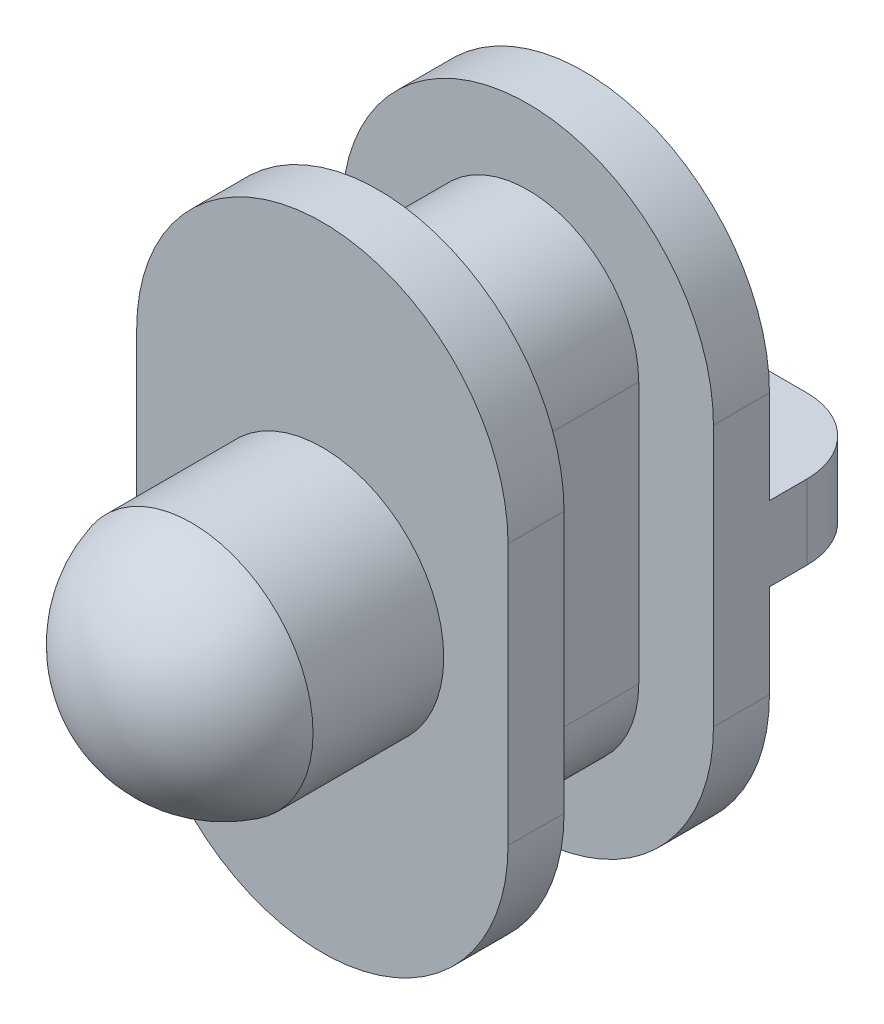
from build123d import *

# Parameters (mm, degrees)
EXTRUSION1_DEPTH  = 4
EXTRUSION2_DEPTH  = 1.5
ESQUISSE3_R       = 3.25
EXTRUSION3_DEPTH  = 3.5
D_ME1_FACE_RADIUS = 3.25
D_ME1_HEIGHT      = 2.5
ESQUISSE4_W       = 9.94349785
ESQUISSE4_H       = 2
EXTRUSION4_DEPTH  = 3
CONG_2_R          = 2


with BuildPart() as part:
    # Esquisse1 → Extrusion1 (new body)
    with BuildSketch(Plane.XY):
        with BuildLine():
            Line((0, 2.420499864), (0, 9.420499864))
            ThreePointArc((0, 9.420499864), (2.971748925, 12.392248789), (5.94349785, 9.420499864))
            Line((5.94349785, 9.420499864), (5.94349785, 2.420499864))
            ThreePointArc((5.94349785, 2.420499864), (2.971748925, -0.551249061), (0, 2.420499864))
        make_face()
    extrude(amount=EXTRUSION1_DEPTH)

    # Esquisse2 → Extrusion2 (add)
    with BuildSketch(Plane.XY.offset(4)):
        with BuildLine():
            Line((-2, 9.420499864), (-2, 2.420499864))
            ThreePointArc((-2, 2.420499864), (2.971748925, -2.551249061), (7.94349785, 2.420499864))
            Line((7.94349785, 2.420499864), (7.94349785, 9.420499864))
            ThreePointArc((7.94349785, 9.420499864), (2.971748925, 14.392248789), (-2, 9.420499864))
        make_face()
    extrusion2 = extrude(amount=EXTRUSION2_DEPTH)

    # Sym_trie1: Extrusion2 across plane
    add(extrusion2.mirror(Plane.XY.offset(2)))

    # Esquisse3 → Extrusion3 (add)
    with BuildSketch(Plane.XY.offset(5.5)):
        with Locations((2.971748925, 5.920499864)):
            Circle(ESQUISSE3_R)
    extrude(amount=EXTRUSION3_DEPTH)

    # D_me1: a dome of height H over a round flat face of radius A is a cap of a sphere of radius (A * A + H * H) / (2 * H)
    d_me1_r = (D_ME1_FACE_RADIUS * D_ME1_FACE_RADIUS + D_ME1_HEIGHT * D_ME1_HEIGHT) / (2 * D_ME1_HEIGHT)
    d_me1_base = Plane((2.971748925, 5.920499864, 9), z_dir=(0, 0, 1))
    with Locations(d_me1_base.offset(D_ME1_HEIGHT - d_me1_r)):
        d_me1_ball = Sphere(d_me1_r, mode=Mode.PRIVATE)
    add(split(d_me1_ball, bisect_by=d_me1_base, keep=Keep.TOP, mode=Mode.PRIVATE))

    # Esquisse4 → Extrusion4 (add)
    with BuildSketch(Plane(origin=(0, 0, -1.5), x_dir=(-1, 0, 0), z_dir=(0, 0, -1))):
        with Locations((-2.971748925, 5.920499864)):
            Rectangle(ESQUISSE4_W, ESQUISSE4_H)
    extrude(amount=EXTRUSION4_DEPTH)

    # Cong_2
    cong_2_edges = [part.edges().sort_by_distance(p)[0] for p in [
        (-2, 5.920499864, -4.5),
        (7.94349785, 5.920499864, -4.5),
    ]]
    fillet(cong_2_edges, radius=CONG_2_R)


solid = part.part
